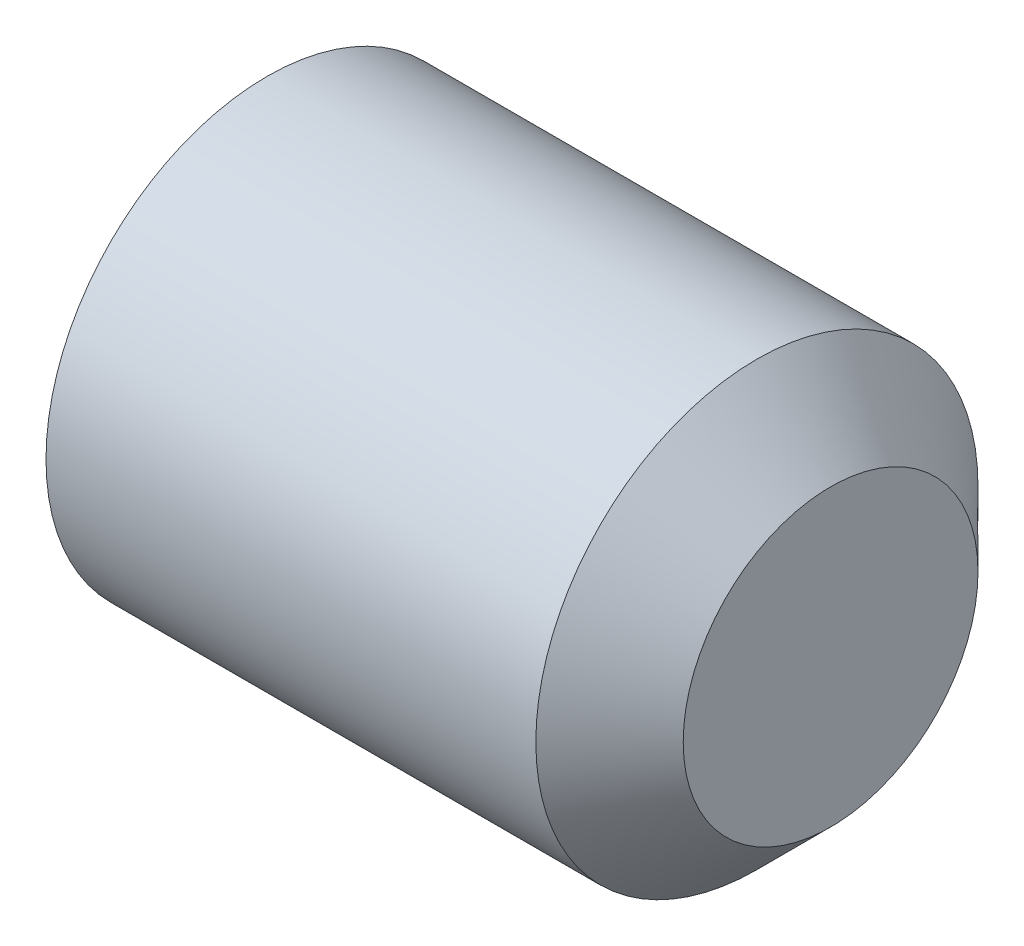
from build123d import *

# Parameters (mm, degrees)
CUT_EXTRUDE1_DEPTH = 1.2


with BuildPart() as part:
    # Sketch1 → Revolve1 (revolve)
    with BuildSketch(Plane.XY, mode=Mode.PRIVATE) as revolve1_sk:
        Polygon((0, 0), (0, 1), (-0.5, 1.5), (-3.823330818, 1.5), (-4, 1.194), (-4, 0), align=None)
    revolve(revolve1_sk.sketch.rotate(Axis((-4, 0, 0), (1, 0, 0)), 90), axis=Axis((-4, 0, 0), (1, 0, 0)))

    # Sketch2 → Cut-Extrude1 (cut)
    with BuildSketch(Plane(origin=(-4, 0, 0), x_dir=(0, 0, -1), z_dir=(1, 0, 0))):
        Polygon((0.75, -0.433012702), (0.75, 0.433012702), (0, 0.866025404), (-0.75, 0.433012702), (-0.75, -0.433012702), (0, -0.866025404), align=None)
    extrude(amount=CUT_EXTRUDE1_DEPTH, mode=Mode.SUBTRACT)


solid = part.part
